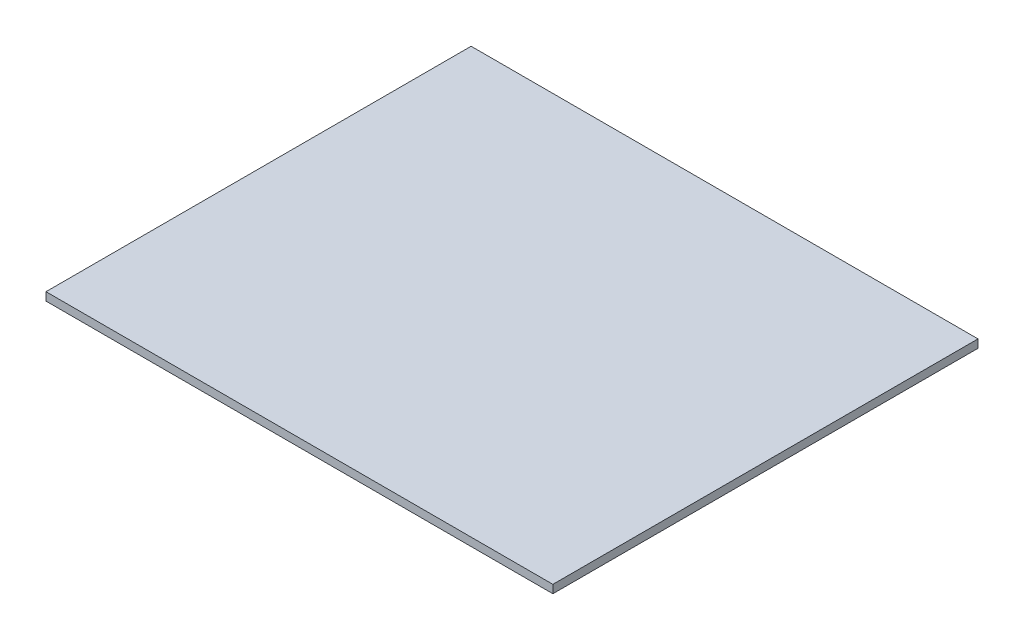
from build123d import *

# Parameters (mm, degrees)
CROQUIS1_W              = 1240
CROQUIS1_H              = 1040
SALIENTE_EXTRUIR1_DEPTH = 20
CROQUIS2_W              = 970
CROQUIS2_H              = 920
SALIENTE_EXTRUIR2_DEPTH = 40
EXTRUIR_L_MINA2_START   = -20
EXTRUIR_L_MINA2_DEPTH   = 20


with BuildPart() as part:
    # Croquis1 → Saliente-Extruir1 (new body)
    with BuildSketch(Plane(origin=(0, 0, 0), x_dir=(1, 0, 0), z_dir=(0, 1, 0))):
        with Locations((620, 520)):
            Rectangle(CROQUIS1_W, CROQUIS1_H)
    extrude(amount=SALIENTE_EXTRUIR1_DEPTH)

    # Croquis2 → Saliente-Extruir2 (add)
    with BuildSketch(Plane.XZ):
        with Locations((695, -520)):
            Rectangle(CROQUIS2_W, CROQUIS2_H)
    extrude(amount=SALIENTE_EXTRUIR2_DEPTH)

    # Croquis3 → Extruir-L_mina2 (add)
    with BuildSketch(Plane.ZY.offset(EXTRUIR_L_MINA2_START)):
        with BuildLine():
            Line((-1000, 10), (-1026.146722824, -288.858409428))
            ThreePointArc((-1026.146722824, -288.858409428), (-797.322937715, -211.183201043), (-700, 10))
            Line((-700, 10), (-730, 10))
            ThreePointArc((-730, 10), (-806.796913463, -178.60691226), (-993.500498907, -259.921759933))
            Line((-993.500498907, -259.921759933), (-970.114159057, 7.385327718))
            Line((-970.114159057, 7.385327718), (-1000, 10))
        make_face()
    extrude(amount=-EXTRUIR_L_MINA2_DEPTH)


solid = part.part
